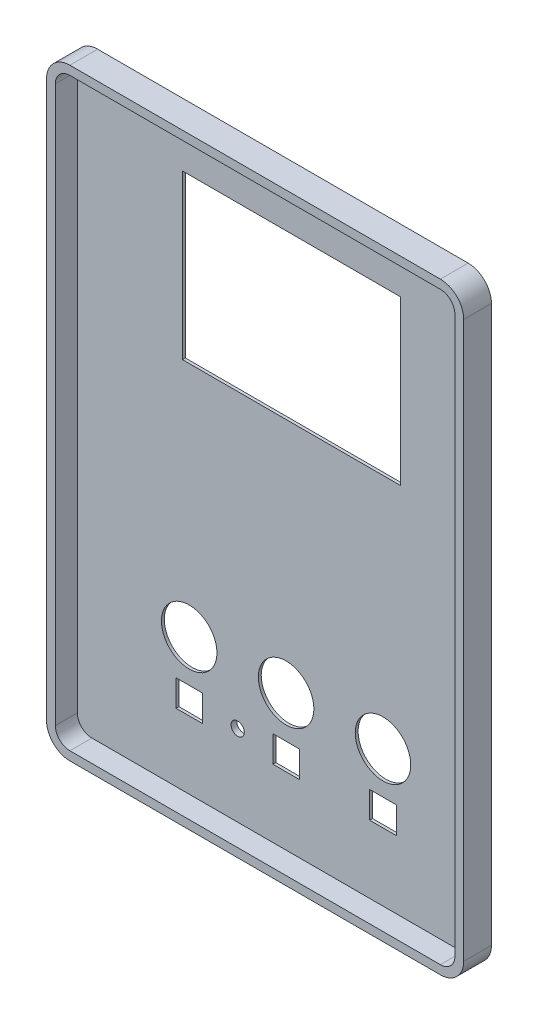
from build123d import *

# Parameters (mm, degrees)
ESQUISSE3_W             = 94.720243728
ESQUISSE3_H             = 136.8
ESQUISSE3_W_2           = 90.720243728
ESQUISSE3_H_2           = 132.8
BOSS_EXTRU_3_DEPTH      = 5
ESQUISSE4_W             = 94.720243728
ESQUISSE4_H             = 136.8
BOSS_EXTRU_4_DEPTH      = 1.3
CONG_2_R                = 3.3
CONG_3_R                = 5.3
ESQUISSE6_W             = 49.5
ESQUISSE6_H             = 37.1
ESQUISSE6_W_2           = 6.040499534
ESQUISSE6_H_2           = 6.040499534
ESQUISSE6_W_3           = 6
ESQUISSE6_H_3           = 6
ESQUISSE6_R             = 6.3
ESQUISSE6_R_2           = 1.5
ENL_V_MAT_EXTRU_1_DEPTH = 1.3
ESQUISSE6_3_W           = 55.5
ESQUISSE6_3_H           = 43.1
ESQUISSE6_3_W_2         = 49.5
ESQUISSE6_3_H_2         = 37.1
ESQUISSE6_3_W_3         = 8
ESQUISSE6_3_H_3         = 8
ESQUISSE6_3_W_4         = 6
ESQUISSE6_3_H_4         = 6
ESQUISSE6_3_W_5         = 8.040499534
ESQUISSE6_3_H_5         = 8.040499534
ESQUISSE6_3_W_6         = 6.040499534
ESQUISSE6_3_H_6         = 6.040499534
ESQUISSE6_3_R           = 8
ESQUISSE6_3_R_2         = 6.3
ENL_V_MAT_EXTRU_2_DEPTH = 0.65


with BuildPart() as part:
    # Esquisse3 → Boss.-Extru.3 (new body)
    with BuildSketch(Plane.XY):
        with Locations((-0.039878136, 0)):
            Rectangle(ESQUISSE3_W, ESQUISSE3_H)
        with Locations((-0.039878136, 0)):
            Rectangle(ESQUISSE3_W_2, ESQUISSE3_H_2, mode=Mode.SUBTRACT)
    extrude(amount=BOSS_EXTRU_3_DEPTH)

    # Esquisse4 → Boss.-Extru.4 (add)
    with BuildSketch(Plane(origin=(0, 0, 0), x_dir=(-1, 0, 0), z_dir=(0, 0, -1))):
        with Locations((0.039878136, 0)):
            Rectangle(ESQUISSE4_W, ESQUISSE4_H)
    extrude(amount=BOSS_EXTRU_4_DEPTH)

    # Cong_2
    cong_2_edges = [part.edges().sort_by_distance(p)[0] for p in [
        (-45.4, -66.4, 2.5),
        (45.320243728, -66.4, 2.5),
        (45.320243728, 66.4, 2.5),
        (-45.4, 66.4, 2.5),
    ]]
    fillet(cong_2_edges, radius=CONG_2_R)

    # Cong_3
    cong_3_edges = [part.edges().sort_by_distance(p)[0] for p in [
        (47.320243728, 68.4, 1.85),
        (47.320243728, -68.4, 1.85),
        (-47.4, -68.4, 1.85),
        (-47.4, 68.4, 1.85),
    ]]
    fillet(cong_3_edges, radius=CONG_3_R)

    # Esquisse6 → Enl_v. mat.-Extru.1 (cut)
    with BuildSketch(Plane(origin=(0, 0, -1.3), x_dir=(-1, 0, 0), z_dir=(0, 0, -1))):
        with Locations((-3.2, 36.84)):
            Rectangle(ESQUISSE6_W, ESQUISSE6_H)
        with Locations((-23.995, -48)):
            Rectangle(ESQUISSE6_W_2, ESQUISSE6_H_2)
        with Locations((-1.995, -48)):
            Rectangle(ESQUISSE6_W_3, ESQUISSE6_H_3)
        with Locations((20.009988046, -35.487849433)):
            Circle(ESQUISSE6_R)
        with Locations((20.005, -48)):
            Rectangle(ESQUISSE6_W_3, ESQUISSE6_H_3)
        with Locations((-23.990011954, -35.487849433)):
            Circle(ESQUISSE6_R)
        with Locations((-1.990011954, -35.487849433)):
            Circle(ESQUISSE6_R)
        with Locations((9, -48)):
            Circle(ESQUISSE6_R_2)
    extrude(amount=-ENL_V_MAT_EXTRU_1_DEPTH, mode=Mode.SUBTRACT)

    # Esquisse6_3 → Enl_v. mat.-Extru.2 (cut)
    # profile 1 of 15: a face of its own
    with BuildSketch(Plane(origin=(0, 0, -1.3), x_dir=(-1, 0, 0), z_dir=(0, 0, -1))):
        with Locations((-3.2, 36.84)):
            Rectangle(ESQUISSE6_3_W, ESQUISSE6_3_H)
        with Locations((-3.2, 36.84)):
            Rectangle(ESQUISSE6_3_W_2, ESQUISSE6_3_H_2, mode=Mode.SUBTRACT)
    # profile 2 of 15: a face of its own
    with BuildSketch(Plane(origin=(0, 0, -1.3), x_dir=(-1, 0, 0), z_dir=(0, 0, -1))):
        with Locations((20.005, -48)):
            Rectangle(ESQUISSE6_3_W_3, ESQUISSE6_3_H_3)
        with Locations((20.005, -48)):
            Rectangle(ESQUISSE6_3_W_4, ESQUISSE6_3_H_4, mode=Mode.SUBTRACT)
    # profile 3 of 15: a face of its own
    with BuildSketch(Plane(origin=(0, 0, -1.3), x_dir=(-1, 0, 0), z_dir=(0, 0, -1))):
        with Locations((-1.995, -48)):
            Rectangle(ESQUISSE6_3_W_3, ESQUISSE6_3_H_3)
        with Locations((-1.995, -48)):
            Rectangle(ESQUISSE6_3_W_4, ESQUISSE6_3_H_4, mode=Mode.SUBTRACT)
    # profile 4 of 15: a face of its own
    with BuildSketch(Plane(origin=(0, 0, -1.3), x_dir=(-1, 0, 0), z_dir=(0, 0, -1))):
        with Locations((-23.995, -48)):
            Rectangle(ESQUISSE6_3_W_5, ESQUISSE6_3_H_5)
        with Locations((-23.995, -48)):
            Rectangle(ESQUISSE6_3_W_6, ESQUISSE6_3_H_6, mode=Mode.SUBTRACT)
    # profile 5 of 15: a face of its own
    with BuildSketch(Plane(origin=(0, 0, -1.3), x_dir=(-1, 0, 0), z_dir=(0, 0, -1))):
        with Locations((-23.990011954, -35.487849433)):
            Circle(ESQUISSE6_3_R)
        with Locations((-23.990011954, -35.487849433)):
            Circle(ESQUISSE6_3_R_2, mode=Mode.SUBTRACT)
    # profile 6 of 15: a face of its own
    with BuildSketch(Plane(origin=(0, 0, -1.3), x_dir=(-1, 0, 0), z_dir=(0, 0, -1))):
        with Locations((-1.990011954, -35.487849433)):
            Circle(ESQUISSE6_3_R)
        with Locations((-1.990011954, -35.487849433)):
            Circle(ESQUISSE6_3_R_2, mode=Mode.SUBTRACT)
    # profile 7 of 15: a face of its own
    with BuildSketch(Plane(origin=(0, 0, -1.3), x_dir=(-1, 0, 0), z_dir=(0, 0, -1))):
        with Locations((20.009988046, -35.487849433)):
            Circle(ESQUISSE6_3_R)
        with Locations((20.009988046, -35.487849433)):
            Circle(ESQUISSE6_3_R_2, mode=Mode.SUBTRACT)
    # profile 8 of 15: a face of its own
    with BuildSketch(Plane(origin=(0, 0, -1.3), x_dir=(-1, 0, 0), z_dir=(0, 0, -1))):
        with BuildLine():
            add(Edge.make_bspline(
                [(-16.49617225, -10.989971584), (-16.497059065, -7.416236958), (-16.496468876, -3.842503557), (-16.496468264, -0.268770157)],
                knots=[17, 17, 17, 17, 18, 18, 18, 18], degree=3))
            add(Edge.make_bspline(
                [(-14.326440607, -13.143272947), (-15.721414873, -13.142650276), (-16.495829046, -12.37473124), (-16.49617225, -10.989971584)],
                knots=[16, 16, 16, 16, 17, 17, 17, 17], degree=3))
            add(Edge.make_bspline(
                [(-8.463938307, -13.137999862), (-10.418067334, -13.147724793), (-12.372263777, -13.144143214), (-14.326440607, -13.143272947)],
                knots=[15, 15, 15, 15, 16, 16, 16, 16], degree=3))
            add(Edge.make_bspline(
                [(-7.922912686, -13.388396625), (-8.076073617, -13.207383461), (-8.227213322, -13.136820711), (-8.463938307, -13.137999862)],
                knots=[14, 14, 14, 14, 15, 15, 15, 15], degree=3))
            add(Edge.make_bspline(
                [(-3.613993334, -18.419304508), (-5.080749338, -16.769338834), (-6.496633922, -15.07402365), (-7.922912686, -13.388396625)],
                knots=[13, 13, 13, 13, 14, 14, 14, 14], degree=3))
            add(Edge.make_bspline(
                [(-2.985949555, -20.135226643), (-2.981196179, -19.449789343), (-3.154215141, -18.936510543), (-3.613993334, -18.419304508)],
                knots=[12, 12, 12, 12, 13, 13, 13, 13], degree=3))
            add(Edge.make_bspline(
                [(2.851735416, -25.994332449), (-0.45095137, -25.98747082), (-3.008848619, -23.437504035), (-2.985949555, -20.135226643)],
                knots=[11, 11, 11, 11, 12, 12, 12, 12], degree=3))
            add(Edge.make_bspline(
                [(14.175245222, -25.99559495), (10.400741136, -25.996999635), (6.626222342, -26.002177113), (2.851735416, -25.994332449)],
                knots=[10, 10, 10, 10, 11, 11, 11, 11], degree=3))
            add(Edge.make_bspline(
                [(15.634705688, -24.530741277), (15.634350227, -25.486995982), (15.128178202, -25.99524194), (14.175245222, -25.99559495)],
                knots=[9, 9, 9, 9, 10, 10, 10, 10], degree=3))
            add(Edge.make_bspline(
                [(15.627927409, -13.648986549), (15.659487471, -17.275983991), (15.636046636, -20.903469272), (15.634705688, -24.530741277)],
                knots=[8, 8, 8, 8, 9, 9, 9, 9], degree=3))
            add(Edge.make_bspline(
                [(11.415056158, -6.323627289), (14.173220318, -7.977765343), (15.599939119, -10.432576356), (15.627927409, -13.648986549)],
                knots=[7, 7, 7, 7, 8, 8, 8, 8], degree=3))
            add(Edge.make_bspline(
                [(3.094802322, -1.401946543), (5.872722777, -3.034872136), (8.651648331, -4.666341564), (11.415056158, -6.323627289)],
                knots=[6, 6, 6, 6, 7, 7, 7, 7], degree=3))
            add(Edge.make_bspline(
                [(2.776103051, -0.835961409), (2.775404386, -1.110247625), (2.85778071, -1.262616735), (3.094802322, -1.401946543)],
                knots=[5, 5, 5, 5, 6, 6, 6, 6], degree=3))
            add(Edge.make_bspline(
                [(2.782028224, 10.44738372), (2.783555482, 6.686263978), (2.785698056, 2.925134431), (2.776103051, -0.835961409)],
                knots=[4, 4, 4, 4, 5, 5, 5, 5], degree=3))
            add(Edge.make_bspline(
                [(-14.363631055, 12.561543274), (-9.357727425, 12.562417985), (-4.351823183, 12.562440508), (0.654079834, 12.56152305), (1.991626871, 12.561277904), (2.781488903, 11.777324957), (2.782028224, 10.44738372)],
                knots=[2, 2, 2, 2, 3, 3, 3, 4, 4, 4, 4], degree=3))
            add(Edge.make_bspline(
                [(-16.496205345, 10.412276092), (-16.495905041, 11.778505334), (-15.71979017, 12.561306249), (-14.363631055, 12.561543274)],
                knots=[1, 1, 1, 1, 2, 2, 2, 2], degree=3))
            add(Edge.make_bspline(
                [(-16.496468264, -0.268770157), (-16.496468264, 3.291578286), (-16.496988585, 6.851927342), (-16.496205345, 10.412276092)],
                knots=[0, 0, 0, 0, 1, 1, 1, 1], degree=3))
        make_face()
        with BuildLine():
            add(Edge.make_bspline(
                [(-15.211055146, 10.350748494), (-15.211384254, 6.817302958), (-15.211202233, 3.283857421), (-15.211188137, -0.249588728)],
                knots=[13, 13, 13, 13, 14, 14, 14, 14], degree=3))
            add(Edge.make_bspline(
                [(-14.290096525, 11.276471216), (-15.026343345, 11.276427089), (-15.210986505, 11.090735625), (-15.211055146, 10.350748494)],
                knots=[12, 12, 12, 12, 13, 13, 13, 13], degree=3))
            add(Edge.make_bspline(
                [(0.60658775, 11.276368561), (-4.358974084, 11.276845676), (-9.324534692, 11.276768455), (-14.290096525, 11.276471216)],
                knots=[11, 11, 11, 11, 12, 12, 12, 12], degree=3))
            add(Edge.make_bspline(
                [(1.496959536, 10.39995905), (1.496905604, 11.077370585), (1.294209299, 11.276302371), (0.60658775, 11.276368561)],
                knots=[10, 10, 10, 10, 11, 11, 11, 11], degree=3))
            add(Edge.make_bspline(
                [(1.497052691, -10.961323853), (1.497459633, -3.840896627), (1.497508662, 3.279531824), (1.496959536, 10.39995905)],
                knots=[9, 9, 9, 9, 10, 10, 10, 10], degree=3))
            add(Edge.make_bspline(
                [(0.586931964, -11.870814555), (1.297670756, -11.814359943), (1.497011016, -11.665497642), (1.497052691, -10.961323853)],
                knots=[8, 8, 8, 8, 9, 9, 9, 9], degree=3))
            add(Edge.make_bspline(
                [(-0.949261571, -11.252672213), (-0.511465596, -11.727487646), (-0.053454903, -11.921677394), (0.586931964, -11.870814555)],
                knots=[7, 7, 7, 7, 8, 8, 8, 8], degree=3))
            add(Edge.make_bspline(
                [(-3.238506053, -9.000525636), (-2.468392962, -9.744390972), (-1.67403986, -10.466612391), (-0.949261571, -11.252672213)],
                knots=[6, 6, 6, 6, 7, 7, 7, 7], degree=3))
            add(Edge.make_bspline(
                [(-6.901438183, -8.333096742), (-5.654454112, -7.751687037), (-4.273908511, -8.000407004), (-3.238506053, -9.000525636)],
                knots=[5, 5, 5, 5, 6, 6, 6, 6], degree=3))
            add(Edge.make_bspline(
                [(-8.721343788, -11.573455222), (-8.842227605, -10.145076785), (-8.139224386, -8.910216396), (-6.901438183, -8.333096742)],
                knots=[4, 4, 4, 4, 5, 5, 5, 5], degree=3))
            add(Edge.make_bspline(
                [(-8.991336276, -11.862205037), (-8.768135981, -11.863090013), (-8.70061549, -11.81839259), (-8.721343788, -11.573455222)],
                knots=[3, 3, 3, 3, 4, 4, 4, 4], degree=3))
            add(Edge.make_bspline(
                [(-14.452095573, -11.856385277), (-12.631847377, -11.86089841), (-10.811567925, -11.854973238), (-8.991336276, -11.862205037)],
                knots=[2, 2, 2, 2, 3, 3, 3, 3], degree=3))
            add(Edge.make_bspline(
                [(-15.210700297, -11.01053686), (-15.210534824, -11.611783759), (-14.998065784, -11.855032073), (-14.452095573, -11.856385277)],
                knots=[1, 1, 1, 1, 2, 2, 2, 2], degree=3))
            add(Edge.make_bspline(
                [(-15.211188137, -0.249588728), (-15.211188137, -3.83657103), (-15.211685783, -7.423554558), (-15.210700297, -11.01053686)],
                knots=[0, 0, 0, 0, 1, 1, 1, 1], degree=3))
        make_face(mode=Mode.SUBTRACT)
        with BuildLine():
            add(Edge.make_bspline(
                [(2.033316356, -12.730035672), (1.757390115, -12.954866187), (1.42438659, -13.052000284), (1.024257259, -13.156086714)],
                knots=[18, 18, 18, 18, 19, 19, 19, 19], degree=3))
            add(Edge.make_bspline(
                [(2.78390604, -11.117351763), (2.784761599, -11.775766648), (2.544759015, -12.313305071), (2.033316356, -12.730035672)],
                knots=[17, 17, 17, 17, 18, 18, 18, 18], degree=3))
            add(Edge.make_bspline(
                [(2.782569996, -3.204998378), (2.78254303, -5.842450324), (2.780481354, -8.479904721), (2.78390604, -11.117351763)],
                knots=[16, 16, 16, 16, 17, 17, 17, 17], degree=3))
            add(Edge.make_bspline(
                [(2.782572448, -2.780956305), (2.782572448, -2.918190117), (2.782572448, -3.061594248), (2.782569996, -3.204998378)],
                knots=[15, 15, 15, 15, 16, 16, 16, 16], degree=3))
            add(Edge.make_bspline(
                [(3.103232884, -2.889867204), (3.015845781, -2.838148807), (2.938928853, -2.746702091), (2.782572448, -2.780956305)],
                knots=[14, 14, 14, 14, 15, 15, 15, 15], degree=3))
            add(Edge.make_bspline(
                [(10.8320432, -7.476905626), (8.268343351, -5.927089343), (5.681408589, -4.4156923), (3.103232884, -2.889867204)],
                knots=[13, 13, 13, 13, 14, 14, 14, 14], degree=3))
            add(Edge.make_bspline(
                [(14.344712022, -13.665835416), (14.328397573, -10.960411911), (13.147680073, -8.876761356), (10.8320432, -7.476905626)],
                knots=[12, 12, 12, 12, 13, 13, 13, 13], degree=3))
            add(Edge.make_bspline(
                [(14.358548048, -24.30920307), (14.344577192, -20.76144899), (14.36610344, -17.213515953), (14.344712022, -13.665835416)],
                knots=[11, 11, 11, 11, 12, 12, 12, 12], degree=3))
            add(Edge.make_bspline(
                [(13.933693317, -24.718383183), (14.257087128, -24.719420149), (14.359908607, -24.654873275), (14.358548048, -24.30920307)],
                knots=[10, 10, 10, 10, 11, 11, 11, 11], degree=3))
            add(Edge.make_bspline(
                [(2.928718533, -24.709636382), (6.597045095, -24.714703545), (10.265398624, -24.706616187), (13.933693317, -24.718383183)],
                knots=[9, 9, 9, 9, 10, 10, 10, 10], degree=3))
            add(Edge.make_bspline(
                [(-1.694100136, -20.076239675), (-1.746595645, -22.755324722), (0.243262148, -24.705927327), (2.928718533, -24.709636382)],
                knots=[8, 8, 8, 8, 9, 9, 9, 9], degree=3))
            add(Edge.make_bspline(
                [(-2.58663901, -17.635671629), (-1.923676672, -18.363462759), (-1.674981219, -19.100566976), (-1.694100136, -20.076239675)],
                knots=[7, 7, 7, 7, 8, 8, 8, 8], degree=3))
            add(Edge.make_bspline(
                [(-6.903512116, -12.609686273), (-5.468895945, -14.289040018), (-4.073217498, -16.003729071), (-2.58663901, -17.635671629)],
                knots=[6, 6, 6, 6, 7, 7, 7, 7], degree=3))
            add(Edge.make_bspline(
                [(-6.880095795, -9.868459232), (-7.647899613, -10.588849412), (-7.655656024, -11.729233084), (-6.903512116, -12.609686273)],
                knots=[5, 5, 5, 5, 6, 6, 6, 6], degree=3))
            add(Edge.make_bspline(
                [(-4.097694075, -9.966667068), (-4.92037009, -9.167832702), (-6.099173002, -9.135760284), (-6.880095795, -9.868459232)],
                knots=[4, 4, 4, 4, 5, 5, 5, 5], degree=3))
            add(Edge.make_bspline(
                [(3.923375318, -17.791079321), (1.259915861, -15.172530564), (-1.418029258, -12.568683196), (-4.097694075, -9.966667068)],
                knots=[3, 3, 3, 3, 4, 4, 4, 4], degree=3))
            add(Edge.make_bspline(
                [(4.598009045, -17.774142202), (4.343601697, -18.05955068), (4.205226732, -18.068177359), (3.923375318, -17.791079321)],
                knots=[2, 2, 2, 2, 3, 3, 3, 3], degree=3))
            add(Edge.make_bspline(
                [(4.56050665, -16.592331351), (5.160937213, -17.175111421), (5.145740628, -17.159667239), (4.598009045, -17.774142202)],
                knots=[1, 1, 1, 1, 2, 2, 2, 2], degree=3))
            add(Edge.make_bspline(
                [(1.024257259, -13.156086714), (2.23858424, -14.336215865), (3.398930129, -15.464908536), (4.56050665, -16.592331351)],
                knots=[0, 0, 0, 0, 1, 1, 1, 1], degree=3))
        make_face(mode=Mode.SUBTRACT)
    # profile 9 of 15: a face of its own
    with BuildSketch(Plane(origin=(0, 0, -1.3), x_dir=(-1, 0, 0), z_dir=(0, 0, -1))):
        with BuildLine():
            Line((-10.749684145, -2.86533547), (-13.245871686, -2.86533547))
            ThreePointArc((-13.245871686, -2.86533547), (-13.72387587, -3.063331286), (-13.921871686, -3.54133547))
            Line((-13.921871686, -3.54133547), (-13.921871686, -6.037051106))
            ThreePointArc((-13.921871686, -6.037051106), (-13.72387587, -6.51505529), (-13.245871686, -6.713051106))
            Line((-13.245871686, -6.713051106), (-10.749684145, -6.713051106))
            ThreePointArc((-10.749684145, -6.713051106), (-10.271679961, -6.51505529), (-10.073684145, -6.037051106))
            Line((-10.073684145, -6.037051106), (-10.073684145, -3.54133547))
            ThreePointArc((-10.073684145, -3.54133547), (-10.271679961, -3.063331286), (-10.749684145, -2.86533547))
        make_face()
        with BuildLine():
            Line((-12.667503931, -5.093877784), (-12.667503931, -4.48460685))
            ThreePointArc((-12.667503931, -4.48460685), (-12.568506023, -4.245604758), (-12.329503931, -4.14660685))
            Line((-12.329503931, -4.14660685), (-11.720236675, -4.14660685))
            ThreePointArc((-11.720236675, -4.14660685), (-11.481234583, -4.245604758), (-11.382236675, -4.48460685))
            Line((-11.382236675, -4.48460685), (-11.382236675, -5.093877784))
            ThreePointArc((-11.382236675, -5.093877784), (-11.481234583, -5.332879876), (-11.720236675, -5.431877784))
            Line((-11.720236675, -5.431877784), (-12.329503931, -5.431877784))
            ThreePointArc((-12.329503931, -5.431877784), (-12.568506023, -5.332879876), (-12.667503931, -5.093877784))
        make_face(mode=Mode.SUBTRACT)
    # profile 10 of 15: a face of its own
    with BuildSketch(Plane(origin=(0, 0, -1.3), x_dir=(-1, 0, 0), z_dir=(0, 0, -1))):
        with BuildLine():
            add(Edge.make_bspline(
                [(-13.012537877, 7.768000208), (-11.261474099, 9.217998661), (-9.106901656, 9.994384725), (-6.449092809, 9.990472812)],
                knots=[7, 7, 7, 7, 8, 8, 8, 8], degree=3))
            add(Edge.make_bspline(
                [(-13.081888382, 6.563262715), (-13.693800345, 7.205114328), (-13.703736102, 7.195641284), (-13.012537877, 7.768000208)],
                knots=[6, 6, 6, 6, 7, 7, 7, 7], degree=3))
            add(Edge.make_bspline(
                [(-12.459903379, 6.534012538), (-12.735209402, 6.283005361), (-12.857453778, 6.327847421), (-13.081888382, 6.563262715)],
                knots=[5, 5, 5, 5, 6, 6, 6, 6], degree=3))
            add(Edge.make_bspline(
                [(-1.579298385, 6.832378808), (-4.741631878, 9.436964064), (-9.404650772, 9.319600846), (-12.459903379, 6.534012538)],
                knots=[4, 4, 4, 4, 5, 5, 5, 5], degree=3))
            add(Edge.make_bspline(
                [(-0.941247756, 6.33997049), (-1.1748741, 6.308718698), (-1.365411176, 6.656216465), (-1.579298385, 6.832378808)],
                knots=[3, 3, 3, 3, 4, 4, 4, 4], degree=3))
            add(Edge.make_bspline(
                [(-0.325355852, 6.878396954), (-0.544430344, 6.706802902), (-0.71686831, 6.369984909), (-0.941247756, 6.33997049)],
                knots=[2, 2, 2, 2, 3, 3, 3, 3], degree=3))
            add(Edge.make_bspline(
                [(-0.343736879, 7.462383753), (-0.105124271, 7.24855967), (-0.045723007, 7.097419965), (-0.325355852, 6.878396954)],
                knots=[1, 1, 1, 1, 2, 2, 2, 2], degree=3))
            add(Edge.make_bspline(
                [(-6.449092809, 9.990472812), (-4.364081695, 9.951883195), (-2.195129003, 9.121448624), (-0.343736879, 7.462383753)],
                knots=[0, 0, 0, 0, 1, 1, 1, 1], degree=3))
        make_face()
    # profile 11 of 15: a face of its own
    with BuildSketch(Plane(origin=(0, 0, -1.3), x_dir=(-1, 0, 0), z_dir=(0, 0, -1))):
        with BuildLine():
            add(Edge.make_bspline(
                [(-11.306731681, 5.840137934), (-10.009408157, 6.881642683), (-8.524338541, 7.398967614), (-6.856688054, 7.425488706)],
                knots=[8, 8, 8, 8, 9, 9, 9, 9], degree=3))
            add(Edge.make_bspline(
                [(-11.374633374, 4.872071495), (-11.877531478, 5.377183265), (-11.879828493, 5.380050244), (-11.306731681, 5.840137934)],
                knots=[7, 7, 7, 7, 8, 8, 8, 8], degree=3))
            add(Edge.make_bspline(
                [(-11.206197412, 4.700558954), (-11.253239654, 4.764433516), (-11.318035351, 4.815225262), (-11.374633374, 4.872071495)],
                knots=[6, 6, 6, 6, 7, 7, 7, 7], degree=3))
            add(Edge.make_bspline(
                [(-10.674924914, 4.678991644), (-10.904425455, 4.473744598), (-11.034846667, 4.467899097), (-11.206197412, 4.700558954)],
                knots=[5, 5, 5, 5, 6, 6, 6, 6], degree=3))
            add(Edge.make_bspline(
                [(-3.423664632, 5.010018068), (-5.618871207, 6.621145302), (-8.643131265, 6.496076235), (-10.674924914, 4.678991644)],
                knots=[4, 4, 4, 4, 5, 5, 5, 5], degree=3))
            add(Edge.make_bspline(
                [(-2.740963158, 4.52824356), (-2.999133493, 4.473562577), (-3.19239659, 4.840282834), (-3.423664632, 5.010018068)],
                knots=[3, 3, 3, 3, 4, 4, 4, 4], degree=3))
            add(Edge.make_bspline(
                [(-2.097364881, 5.104250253), (-2.323234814, 4.917871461), (-2.49748931, 4.57981058), (-2.740963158, 4.52824356)],
                knots=[2, 2, 2, 2, 3, 3, 3, 3], degree=3))
            add(Edge.make_bspline(
                [(-2.107418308, 5.594371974), (-1.894648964, 5.407519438), (-1.874404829, 5.288228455), (-2.097364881, 5.104250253)],
                knots=[1, 1, 1, 1, 2, 2, 2, 2], degree=3))
            add(Edge.make_bspline(
                [(-6.856688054, 7.425488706), (-5.05329424, 7.397516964), (-3.469913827, 6.7909026), (-2.107418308, 5.594371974)],
                knots=[0, 0, 0, 0, 1, 1, 1, 1], degree=3))
        make_face()
    # profile 12 of 15: a face of its own
    with BuildSketch(Plane(origin=(0, 0, -1.3), x_dir=(-1, 0, 0), z_dir=(0, 0, -1))):
        with BuildLine():
            add(Edge.make_bspline(
                [(-8.791823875, -6.020052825), (-8.803175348, -5.605397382), (-8.794283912, -5.190187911), (-8.794236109, -4.775221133)],
                knots=[8, 8, 8, 8, 9, 9, 9, 9], degree=3))
            add(Edge.make_bspline(
                [(-8.115795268, -6.702566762), (-8.541699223, -6.696680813), (-8.780091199, -6.448685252), (-8.791823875, -6.020052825)],
                knots=[7, 7, 7, 7, 8, 8, 8, 8], degree=3))
            add(Edge.make_bspline(
                [(-5.626085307, -6.702917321), (-6.455880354, -6.713583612), (-7.286021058, -6.71403468), (-8.115795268, -6.702566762)],
                knots=[6, 6, 6, 6, 7, 7, 7, 7], degree=3))
            add(Edge.make_bspline(
                [(-4.943708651, -6.02672324), (-4.949605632, -6.452217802), (-5.198096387, -6.697418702), (-5.626085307, -6.702917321)],
                knots=[5, 5, 5, 5, 6, 6, 6, 6], degree=3))
            add(Edge.make_bspline(
                [(-4.943345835, -3.537014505), (-4.932608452, -4.366807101), (-4.93221009, -5.19694903), (-4.943708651, -6.02672324)],
                knots=[4, 4, 4, 4, 5, 5, 5, 5], degree=3))
            add(Edge.make_bspline(
                [(-5.619470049, -2.855213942), (-5.193957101, -2.860924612), (-4.948892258, -3.108477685), (-4.943345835, -3.537014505)],
                knots=[3, 3, 3, 3, 4, 4, 4, 4], degree=3))
            add(Edge.make_bspline(
                [(-8.109184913, -2.854925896), (-7.279386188, -2.844449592), (-6.449252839, -2.844078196), (-5.619470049, -2.855213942)],
                knots=[2, 2, 2, 2, 3, 3, 3, 3], degree=3))
            add(Edge.make_bspline(
                [(-8.791568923, -3.530399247), (-8.77915842, -3.103949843), (-8.538468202, -2.860344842), (-8.109184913, -2.854925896)],
                knots=[1, 1, 1, 1, 2, 2, 2, 2], degree=3))
            add(Edge.make_bspline(
                [(-8.794236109, -4.775221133), (-8.794189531, -4.360255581), (-8.803633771, -3.945014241), (-8.791568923, -3.530399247)],
                knots=[0, 0, 0, 0, 1, 1, 1, 1], degree=3))
        make_face()
        with BuildLine():
            Line((-7.513003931, -5.093877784), (-7.513003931, -4.48460685))
            ThreePointArc((-7.513003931, -4.48460685), (-7.414006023, -4.245604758), (-7.175003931, -4.14660685))
            Line((-7.175003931, -4.14660685), (-7.066854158, -4.14660685))
            Line((-7.066854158, -4.14660685), (-6.565736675, -4.14660685))
            ThreePointArc((-6.565736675, -4.14660685), (-6.326734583, -4.245604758), (-6.227736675, -4.48460685))
            Line((-6.227736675, -4.48460685), (-6.227736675, -5.093877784))
            ThreePointArc((-6.227736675, -5.093877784), (-6.326734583, -5.332879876), (-6.565736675, -5.431877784))
            Line((-6.565736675, -5.431877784), (-7.175003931, -5.431877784))
            ThreePointArc((-7.175003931, -5.431877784), (-7.414006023, -5.332879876), (-7.513003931, -5.093877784))
        make_face(mode=Mode.SUBTRACT)
    # profile 13 of 15: a face of its own
    with BuildSketch(Plane(origin=(0, 0, -1.3), x_dir=(-1, 0, 0), z_dir=(0, 0, -1))):
        with BuildLine():
            add(Edge.make_bspline(
                [(0.210275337, -3.593733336), (0.217705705, -3.995177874), (0.211800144, -4.39687001), (0.211832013, -4.79845183)],
                knots=[8, 8, 8, 8, 9, 9, 9, 9], degree=3))
            add(Edge.make_bspline(
                [(-0.501949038, -2.864036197), (-0.032492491, -2.869135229), (0.201413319, -3.114766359), (0.210275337, -3.593733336)],
                knots=[7, 7, 7, 7, 8, 8, 8, 8], degree=3))
            add(Edge.make_bspline(
                [(-2.911398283, -2.863476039), (-2.10829593, -2.856434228), (-1.305017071, -2.855313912), (-0.501949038, -2.864036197)],
                knots=[6, 6, 6, 6, 7, 7, 7, 7], degree=3))
            add(Edge.make_bspline(
                [(-3.64105007, -3.574467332), (-3.635924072, -3.104586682), (-3.390655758, -2.867677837), (-2.911398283, -2.863476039)],
                knots=[5, 5, 5, 5, 6, 6, 6, 6], degree=3))
            add(Edge.make_bspline(
                [(-3.641609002, -5.983917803), (-3.648671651, -5.180815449), (-3.649806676, -4.377537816), (-3.64105007, -3.574467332)],
                knots=[4, 4, 4, 4, 5, 5, 5, 5], degree=3))
            add(Edge.make_bspline(
                [(-2.93061771, -6.714345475), (-3.399816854, -6.709087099), (-3.63739985, -6.462573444), (-3.641609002, -5.983917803)],
                knots=[3, 3, 3, 3, 4, 4, 4, 4], degree=3))
            add(Edge.make_bspline(
                [(-0.521170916, -6.714889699), (-1.324263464, -6.722396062), (-2.127554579, -6.723344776), (-2.93061771, -6.714345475)],
                knots=[2, 2, 2, 2, 3, 3, 3, 3], degree=3))
            add(Edge.make_bspline(
                [(0.210687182, -5.96302158), (0.203038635, -6.467152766), (-0.028236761, -6.71028341), (-0.521170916, -6.714889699)],
                knots=[1, 1, 1, 1, 2, 2, 2, 2], degree=3))
            add(Edge.make_bspline(
                [(0.211832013, -4.79845183), (0.21186143, -5.186647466), (0.216575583, -5.574915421), (0.210687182, -5.96302158)],
                knots=[0, 0, 0, 0, 1, 1, 1, 1], degree=3))
        make_face()
        with BuildLine():
            Line((-2.331575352, -5.093877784), (-2.331575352, -4.48460685))
            ThreePointArc((-2.331575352, -4.48460685), (-2.232577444, -4.245604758), (-1.993575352, -4.14660685))
            Line((-1.993575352, -4.14660685), (-1.384308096, -4.14660685))
            ThreePointArc((-1.384308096, -4.14660685), (-1.145306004, -4.245604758), (-1.046308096, -4.48460685))
            Line((-1.046308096, -4.48460685), (-1.046308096, -5.093877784))
            ThreePointArc((-1.046308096, -5.093877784), (-1.145306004, -5.332879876), (-1.384308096, -5.431877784))
            Line((-1.384308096, -5.431877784), (-1.993575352, -5.431877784))
            ThreePointArc((-1.993575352, -5.431877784), (-2.232577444, -5.332879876), (-2.331575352, -5.093877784))
        make_face(mode=Mode.SUBTRACT)
    # profile 14 of 15: a face of its own
    with BuildSketch(Plane(origin=(0, 0, -1.3), x_dir=(-1, 0, 0), z_dir=(0, 0, -1))):
        with BuildLine():
            add(Edge.make_bspline(
                [(-8.783257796, 0.364197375), (-8.783097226, 1.408857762), (-7.912367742, 2.278979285), (-6.867744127, 2.278370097)],
                knots=[3, 3, 3, 3, 4, 4, 4, 4], degree=3))
            add(Edge.make_bspline(
                [(-6.848324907, -1.572816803), (-7.914094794, -1.577532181), (-8.78342327, -0.707267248), (-8.783257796, 0.364197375)],
                knots=[2, 2, 2, 2, 3, 3, 3, 3], degree=3))
            add(Edge.make_bspline(
                [(-4.93220205, 0.341956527), (-4.936840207, -0.707448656), (-5.798170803, -1.568172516), (-6.848324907, -1.572816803)],
                knots=[1, 1, 1, 1, 2, 2, 2, 2], degree=3))
            add(Edge.make_bspline(
                [(-6.867744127, 2.278370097), (-5.79645846, 2.277746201), (-4.927487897, 1.408384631), (-4.93220205, 0.341956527)],
                knots=[0, 0, 0, 0, 1, 1, 1, 1], degree=3))
        make_face()
        with BuildLine():
            add(Edge.make_bspline(
                [(-6.850810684, -0.287929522), (-6.505304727, -0.284101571), (-6.218802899, 0.003791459), (-6.21747666, 0.348479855)],
                knots=[3, 3, 3, 3, 4, 4, 4, 4], degree=3))
            add(Edge.make_bspline(
                [(-7.497304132, 0.335373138), (-7.488108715, -0.009453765), (-7.195313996, -0.291747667), (-6.850810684, -0.287929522)],
                knots=[2, 2, 2, 2, 3, 3, 3, 3], degree=3))
            add(Edge.make_bspline(
                [(-6.844557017, 0.991580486), (-7.2049519, 0.999993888), (-7.506931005, 0.696415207), (-7.497304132, 0.335373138)],
                knots=[1, 1, 1, 1, 2, 2, 2, 2], degree=3))
            add(Edge.make_bspline(
                [(-6.21747666, 0.348479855), (-6.21614797, 0.693683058), (-6.498753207, 0.983509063), (-6.844557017, 0.991580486)],
                knots=[0, 0, 0, 0, 1, 1, 1, 1], degree=3))
        make_face(mode=Mode.SUBTRACT)
    # profile 15 of 15: a face of its own
    with BuildSketch(Plane(origin=(0, 0, -1.3), x_dir=(-1, 0, 0), z_dir=(0, 0, -1))):
        with BuildLine():
            add(Edge.make_bspline(
                [(-3.974603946, 3.797745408), (-3.88386325, 3.721067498), (-3.801380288, 3.634616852), (-3.701527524, 3.539881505)],
                knots=[8, 8, 8, 8, 9, 9, 9, 9], degree=3))
            add(Edge.make_bspline(
                [(-9.536341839, 3.956464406), (-7.870136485, 5.201181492), (-5.558045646, 5.135755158), (-3.974603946, 3.797745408)],
                knots=[7, 7, 7, 7, 8, 8, 8, 8], degree=3))
            add(Edge.make_bspline(
                [(-9.611107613, 3.108383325), (-10.068979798, 3.55856774), (-10.068994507, 3.558553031), (-9.536341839, 3.956464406)],
                knots=[6, 6, 6, 6, 7, 7, 7, 7], degree=3))
            add(Edge.make_bspline(
                [(-9.441492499, 2.93830366), (-9.488752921, 3.00189324), (-9.553950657, 3.052186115), (-9.611107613, 3.108383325)],
                knots=[5, 5, 5, 5, 6, 6, 6, 6], degree=3))
            add(Edge.make_bspline(
                [(-8.806992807, 2.880275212), (-9.091907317, 2.653177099), (-9.248920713, 2.679188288), (-9.441492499, 2.93830366)],
                knots=[4, 4, 4, 4, 5, 5, 5, 5], degree=3))
            add(Edge.make_bspline(
                [(-5.235109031, 3.13504415), (-6.3806616, 3.774886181), (-7.763742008, 3.711826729), (-8.806992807, 2.880275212)],
                knots=[3, 3, 3, 3, 4, 4, 4, 4], degree=3))
            add(Edge.make_bspline(
                [(-4.491601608, 2.749449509), (-4.817879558, 2.593088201), (-4.988466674, 2.997283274), (-5.235109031, 3.13504415)],
                knots=[2, 2, 2, 2, 3, 3, 3, 3], degree=3))
            add(Edge.make_bspline(
                [(-3.827206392, 3.379087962), (-4.044231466, 3.161606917), (-4.229588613, 2.875013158), (-4.491601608, 2.749449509)],
                knots=[1, 1, 1, 1, 2, 2, 2, 2], degree=3))
            add(Edge.make_bspline(
                [(-3.701527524, 3.539881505), (-3.749155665, 3.478235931), (-3.78294778, 3.423440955), (-3.827206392, 3.379087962)],
                knots=[0, 0, 0, 0, 1, 1, 1, 1], degree=3))
        make_face()
    extrude(amount=-ENL_V_MAT_EXTRU_2_DEPTH, mode=Mode.SUBTRACT)


solid = part.part
